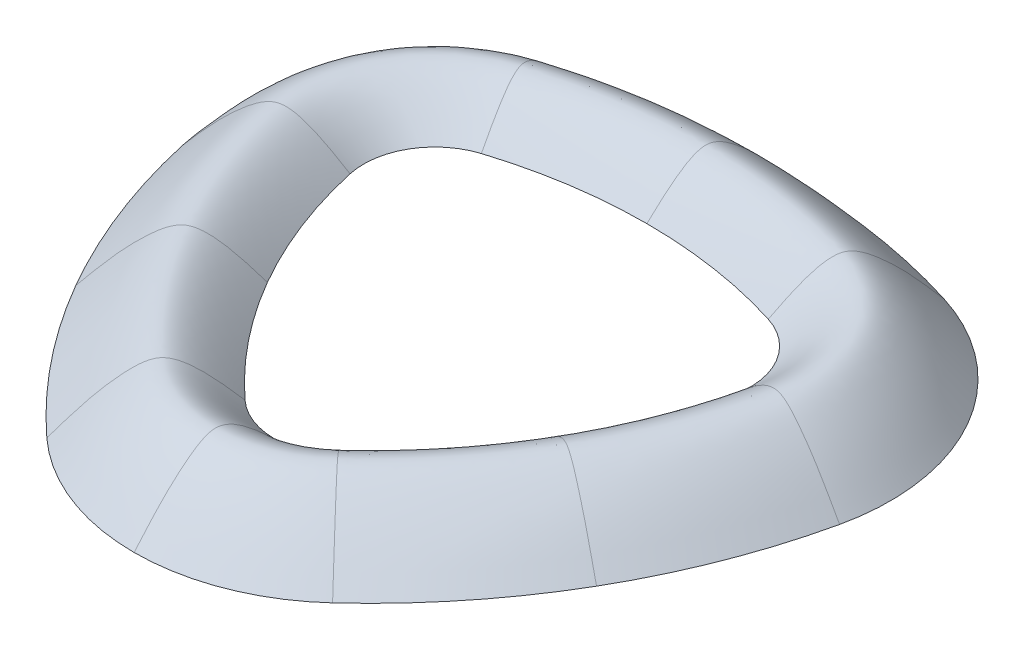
from build123d import *


with BuildPart() as part:
    # Balayage1: sweep along a path in Esquisse7
    with BuildLine(Plane(origin=(0, 110, 0), x_dir=(-1, 0, 0), z_dir=(0, 1, 0))) as balayage1_path:
        ThreePointArc((3.172748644, 43.451470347), (-17.102622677, 51.34017254), (-37.377993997, 43.451470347))
        ThreePointArc((-37.377993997, 43.451470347), (-46.507837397, 33.698545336), (-54.049684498, 22.671572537))
        ThreePointArc((-54.049684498, 22.671572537), (-59.828393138, 10.626671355), (-63.70975101, -2.156449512))
        ThreePointArc((-63.70975101, -2.156449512), (-60.40388948, -23.659821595), (-43.434353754, -37.274467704))
        ThreePointArc((-43.434353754, -37.274467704), (-30.423167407, -40.304673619), (-17.102622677, -41.322615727))
        ThreePointArc((-17.102622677, -41.322615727), (-3.782060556, -40.304670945), (9.229141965, -37.274457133))
        ThreePointArc((9.229141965, -37.274457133), (26.198644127, -23.659821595), (29.504513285, -2.156483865))
        ThreePointArc((29.504513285, -2.156483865), (25.623154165, 10.626654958), (19.844439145, 22.671572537))
        ThreePointArc((19.844439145, 22.671572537), (12.302592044, 33.698545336), (3.172748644, 43.451470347))
    # Esquisse6 → Balayage1 (sweep)
    with BuildSketch(Plane(origin=(17.1, 0, 0), x_dir=(0, 0, -1), z_dir=(1, 0, 0))):
        with BuildLine():
            Line((-37.84017254, 114), (-31.434377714, 114.034291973))
            add(Edge.make_bspline(
                [(-51.34017254, 110), (-49.311949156, 112.293182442), (-46.168003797, 116.13988834), (-41.00321144, 119.628897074), (-37.517111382, 119.363847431), (-34.663974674, 117.097954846), (-31.434377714, 114.034291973)],
                knots=[0, 0, 0, 0, 0.461577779, 0.652295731, 0.706137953, 1, 1, 1, 1], degree=3))
            Line((-51.34017254, 110), (-37.84017254, 110))
            Line((-37.84017254, 110), (-37.84017254, 114))
        make_face()
    sweep(path=balayage1_path.line)


solid = part.part
